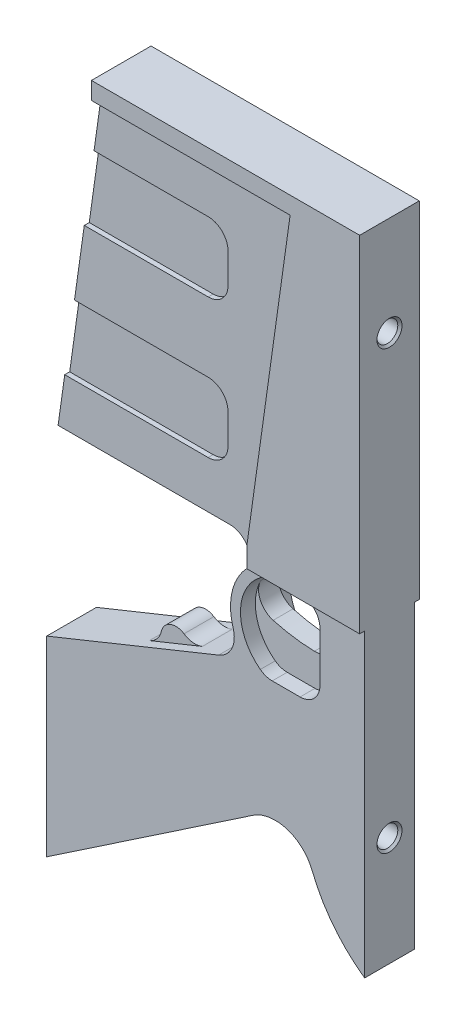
from build123d import *

# Parameters (mm, degrees)
EXTRUDE_5_DEPTH              = 6
EXTRUDE_6_DEPTH              = 4
EXTRUDE_8_DEPTH              = 3
EXTRUDE_11_DEPTH             = 5
EXTRUDE_12_DEPTH             = 3
EXTRUDE_13_DEPTH             = 2
HOLE_WIZARD_M5_1_D           = 4.2
HOLE_WIZARD_M5_1_DEPTH       = 12
HOLE_WIZARD_M5_1_CSINK_D     = 5.05
HOLE_WIZARD_M5_1_CSINK_ANGLE = 90
HOLE_WIZARD_M5_1_TIP         = 1.2618073


with BuildPart() as part:
    # Sketch 1 → Extrude 5 (new, symmetric)
    with BuildSketch(Plane.XY):
        Polygon((-9, 60.5), (0, 60.5), (0, 130), (-54, 130), (-54, 126.5), (-14, 126.5), (-22.714732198, 64.491458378), (-22.714732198, 60.5), align=None)
    extrude(amount=EXTRUDE_5_DEPTH, both=True)

    # Sketch 1_5 → Extrude 6 (add, symmetric)
    with BuildSketch(Plane.XY):
        with BuildLine():
            Line((-24.090454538, 60.5), (-22.714732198, 60.5))
            Line((-22.714732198, 60.5), (-22.714732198, 64.491458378))
            Line((-22.714732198, 64.491458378), (-14, 126.5))
            Line((-14, 126.5), (-54, 126.5))
            Line((-54, 126.5), (-55.475678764, 116))
            Line((-55.475678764, 116), (-32.5, 116))
            ThreePointArc((-32.5, 116), (-29.671572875, 114.828427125), (-28.5, 112))
            Line((-28.5, 112), (-28.5, 106))
            ThreePointArc((-28.5, 106), (-29.671572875, 103.171572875), (-32.5, 102))
            Line((-32.5, 102), (-57.44325045, 102))
            Line((-57.44325045, 102), (-59.410822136, 88))
            Line((-59.410822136, 88), (-32.5, 88))
            ThreePointArc((-32.5, 88), (-29.671572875, 86.828427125), (-28.5, 84))
            Line((-28.5, 84), (-28.5, 78))
            ThreePointArc((-28.5, 78), (-29.671572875, 75.171572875), (-32.5, 74))
            Line((-32.5, 74), (-61.378393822, 74))
            Line((-61.378393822, 74), (-62.713531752, 64.5))
            Line((-62.713531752, 64.5), (-28.090454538, 64.5))
            ThreePointArc((-28.090454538, 64.5), (-25.262027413, 63.328427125), (-24.090454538, 60.5))
        make_face()
    extrude(amount=EXTRUDE_6_DEPTH, both=True)

    # Sketch 1_7 → Extrude 8 (add, symmetric)
    with BuildSketch(Plane.XY):
        with BuildLine():
            Line((-32.5, 116), (-55.475678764, 116))
            Line((-55.475678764, 116), (-57.44325045, 102))
            Line((-57.44325045, 102), (-32.5, 102))
            ThreePointArc((-32.5, 102), (-29.671572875, 103.171572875), (-28.5, 106))
            Line((-28.5, 106), (-28.5, 112))
            ThreePointArc((-28.5, 112), (-29.671572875, 114.828427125), (-32.5, 116))
        make_face()
        with BuildLine():
            Line((-59.410822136, 88), (-61.378393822, 74))
            Line((-61.378393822, 74), (-32.5, 74))
            ThreePointArc((-32.5, 74), (-29.671572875, 75.171572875), (-28.5, 78))
            Line((-28.5, 78), (-28.5, 84))
            ThreePointArc((-28.5, 84), (-29.671572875, 86.828427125), (-32.5, 88))
            Line((-32.5, 88), (-59.410822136, 88))
        make_face()
    extrude(amount=EXTRUDE_8_DEPTH, both=True)

    # Sketch 1_11 → Extrude 11 (add, symmetric)
    with BuildSketch(Plane.XY):
        with BuildLine():
            ThreePointArc((-10.561600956, 13.444523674), (-6.258819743, 5.953960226), (0, 0))
            Line((0, 0), (0, 60.5))
            Line((0, 60.5), (-9, 60.5))
            Line((-9, 60.5), (-22.714732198, 60.5))
            Line((-22.714732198, 60.5), (-22.714732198, 60.491458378))
            ThreePointArc((-22.714732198, 60.491458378), (-23.840841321, 59.414155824), (-24.817840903, 58.2))
            ThreePointArc((-24.817840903, 58.2), (-26.853536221, 53.169138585), (-26.4647206, 47.755965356))
            ThreePointArc((-26.4647206, 47.755965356), (-26.726961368, 44.112432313), (-29.385728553, 41.607425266))
            Line((-29.385728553, 41.607425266), (-34.673734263, 39.470932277))
            Line((-34.673734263, 39.470932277), (-45.326265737, 35.16703019))
            Line((-45.326265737, 35.16703019), (-64, 27.622351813))
            Line((-64, 27.622351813), (-64, -10.877648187))
            Line((-64, -10.877648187), (-22.473543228, 17.13230058))
            ThreePointArc((-22.473543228, 17.13230058), (-15.634092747, 18.142151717), (-10.561600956, 13.444523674))
        make_face()
        with BuildLine():
            ThreePointArc((-13, 60.491458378), (-10.171572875, 59.319885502), (-9, 56.491458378))
            Line((-9, 56.491458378), (-9, 52.91306727))
            Line((-9, 52.91306727), (-9, 46.5))
            ThreePointArc((-9, 46.5), (-10.171572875, 43.671572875), (-13, 42.5))
            Line((-13, 42.5), (-18.6, 42.5))
            ThreePointArc((-18.6, 42.5), (-19.864911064, 42.705266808), (-21, 43.3))
            ThreePointArc((-21, 43.3), (-24.739823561, 49.033761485), (-23.915341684, 55.829534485))
            ThreePointArc((-23.915341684, 55.829534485), (-22.263119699, 58.173652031), (-20.013526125, 59.952430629))
            ThreePointArc((-20.013526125, 59.952430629), (-19.046410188, 60.354351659), (-18.008115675, 60.491458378))
            Line((-18.008115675, 60.491458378), (-13, 60.491458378))
        make_face(mode=Mode.SUBTRACT)
    extrude(amount=EXTRUDE_11_DEPTH, both=True)

    # Sketch 1_12 → Extrude 12 (add, symmetric)
    with BuildSketch(Plane.XY):
        with BuildLine():
            ThreePointArc((-42.924868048, 37.986174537), (-43.779668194, 36.281959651), (-45.326265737, 35.16703019))
            Line((-45.326265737, 35.16703019), (-34.673734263, 39.470932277))
            ThreePointArc((-34.673734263, 39.470932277), (-36.560758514, 39.198588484), (-38.359497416, 39.830704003))
            ThreePointArc((-38.359497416, 39.830704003), (-41.12381978, 40.100532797), (-42.924868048, 37.986174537))
        make_face()
    extrude(amount=EXTRUDE_12_DEPTH, both=True)

    # Sketch 1_13 → Extrude 13 (add, symmetric)
    with BuildSketch(Plane.XY):
        with BuildLine():
            Line((-9, 46.5), (-9, 52.91306727))
            ThreePointArc((-9, 52.91306727), (-10.212933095, 50.043876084), (-13.116129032, 48.91475337))
            ThreePointArc((-13.116129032, 48.91475337), (-17.302383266, 49.28879938), (-21.41361856, 50.161942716))
            ThreePointArc((-21.41361856, 50.161942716), (-24.008562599, 52.402449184), (-23.915341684, 55.829534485))
            ThreePointArc((-23.915341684, 55.829534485), (-24.739823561, 49.033761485), (-21, 43.3))
            ThreePointArc((-21, 43.3), (-19.864911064, 42.705266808), (-18.6, 42.5))
            Line((-18.6, 42.5), (-13, 42.5))
            ThreePointArc((-13, 42.5), (-10.171572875, 43.671572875), (-9, 46.5))
        make_face()
    extrude(amount=EXTRUDE_13_DEPTH, both=True)

    # Hole Wizard M5 _1
    with Locations(Plane(origin=(0, 0, 0), x_dir=(0, 0, -1), z_dir=(1, 0, 0))):
        with Locations((0, 110), (0, 22)):
            CounterSinkHole(HOLE_WIZARD_M5_1_D / 2, HOLE_WIZARD_M5_1_CSINK_D / 2, depth=HOLE_WIZARD_M5_1_DEPTH, counter_sink_angle=HOLE_WIZARD_M5_1_CSINK_ANGLE)
            with Locations((0, 0, -(HOLE_WIZARD_M5_1_DEPTH + HOLE_WIZARD_M5_1_TIP / 2))):  # 118° drill point
                Cone(0, HOLE_WIZARD_M5_1_D / 2, HOLE_WIZARD_M5_1_TIP, mode=Mode.SUBTRACT)


solid = part.part
